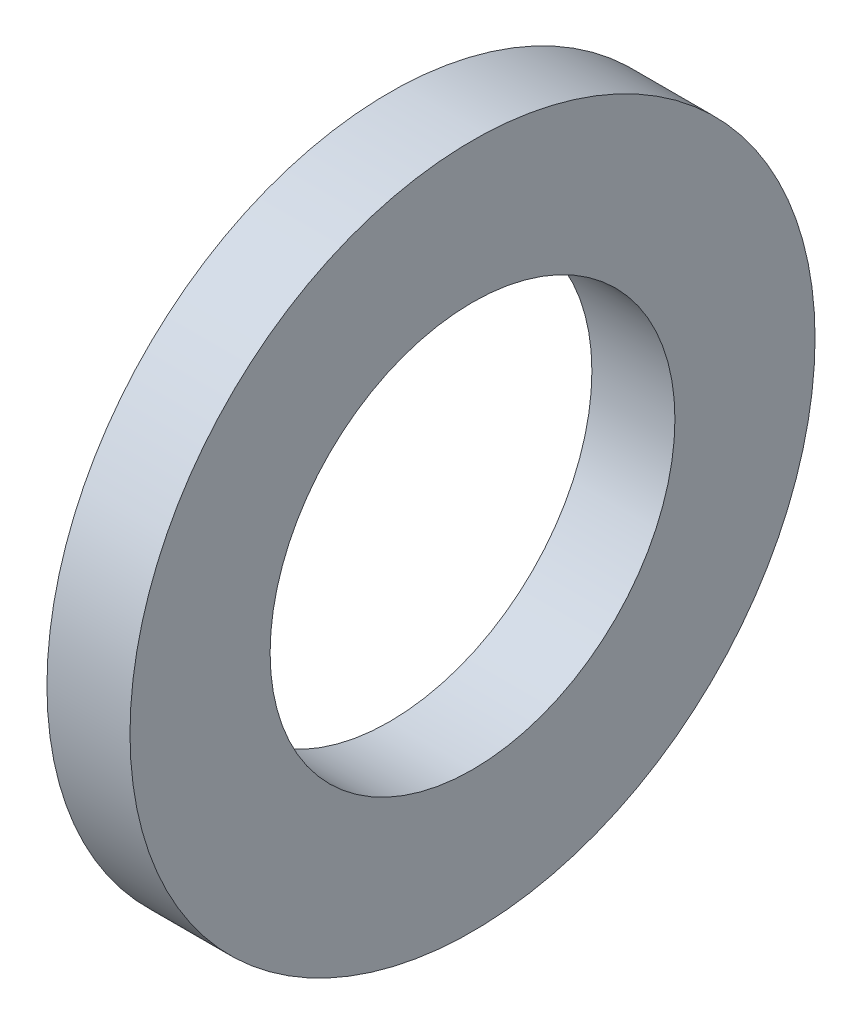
ISO-10303-21;
HEADER;
FILE_DESCRIPTION(('STEP AP214'),'2;1');
FILE_NAME('part.step','',(''),(''),'','','');
FILE_SCHEMA(('AUTOMOTIVE_DESIGN { 1 0 10303 214 1 1 1 1 }'));
ENDSEC;
DATA;
#1=APPLICATION_CONTEXT('core data for automotive mechanical design processes');
#2=APPLICATION_PROTOCOL_DEFINITION('international standard','automotive_design',2000,#1);
#3=PRODUCT_CONTEXT('',#1,'mechanical');
#4=PRODUCT('Part','Part','',(#3));
#5=PRODUCT_RELATED_PRODUCT_CATEGORY('part','',(#4));
#6=PRODUCT_DEFINITION_FORMATION('','',#4);
#7=PRODUCT_DEFINITION_CONTEXT('part definition',#1,'design');
#8=PRODUCT_DEFINITION('design','',#6,#7);
#9=PRODUCT_DEFINITION_SHAPE('','',#8);
#10=(LENGTH_UNIT() NAMED_UNIT(*) SI_UNIT(.MILLI.,.METRE.));
#11=(NAMED_UNIT(*) PLANE_ANGLE_UNIT() SI_UNIT($,.RADIAN.));
#12=(NAMED_UNIT(*) SI_UNIT($,.STERADIAN.) SOLID_ANGLE_UNIT());
#13=UNCERTAINTY_MEASURE_WITH_UNIT(LENGTH_MEASURE(1.E-05),#10,'distance_accuracy_value','');
#14=(GEOMETRIC_REPRESENTATION_CONTEXT(3) GLOBAL_UNCERTAINTY_ASSIGNED_CONTEXT((#13)) GLOBAL_UNIT_ASSIGNED_CONTEXT((#10,
#11,#12)) REPRESENTATION_CONTEXT('',''));
#15=CARTESIAN_POINT('',(0.,0.,0.));
#16=DIRECTION('',(0.,0.,1.));
#17=DIRECTION('',(1.,0.,0.));
#18=AXIS2_PLACEMENT_3D('',#15,#16,#17);
#19=CARTESIAN_POINT('',(8.,0.,0.));
#20=DIRECTION('',(1.,0.,0.));
#21=DIRECTION('',(0.,0.,-1.));
#22=AXIS2_PLACEMENT_3D('',#19,#20,#21);
#23=PLANE('',#22);
#24=CARTESIAN_POINT('',(8.,0.,0.));
#25=DIRECTION('',(1.,0.,0.));
#26=DIRECTION('',(0.,0.,-1.));
#27=AXIS2_PLACEMENT_3D('',#24,#25,#26);
#28=CIRCLE('',#27,33.);
#29=CARTESIAN_POINT('',(8.,0.,-33.));
#30=VERTEX_POINT('',#29);
#31=EDGE_CURVE('E10',#30,#30,#28,.T.);
#32=ORIENTED_EDGE('',*,*,#31,.T.);
#33=EDGE_LOOP('',(#32));
#34=FACE_BOUND('',#33,.T.);
#35=CARTESIAN_POINT('',(8.,0.,0.));
#36=DIRECTION('',(1.,0.,0.));
#37=DIRECTION('',(0.,0.,-1.));
#38=AXIS2_PLACEMENT_3D('',#35,#36,#37);
#39=CIRCLE('',#38,19.5);
#40=CARTESIAN_POINT('',(8.,0.,-19.5));
#41=VERTEX_POINT('',#40);
#42=EDGE_CURVE('E42',#41,#41,#39,.T.);
#43=ORIENTED_EDGE('',*,*,#42,.F.);
#44=EDGE_LOOP('',(#43));
#45=FACE_BOUND('',#44,.T.);
#46=ADVANCED_FACE('F31',(#34,#45),#23,.T.);
#47=CARTESIAN_POINT('',(0.,0.,0.));
#48=DIRECTION('',(1.,0.,0.));
#49=DIRECTION('',(0.,0.,-1.));
#50=AXIS2_PLACEMENT_3D('',#47,#48,#49);
#51=PLANE('',#50);
#52=CARTESIAN_POINT('',(0.,0.,0.));
#53=DIRECTION('',(1.,0.,0.));
#54=DIRECTION('',(0.,0.,-1.));
#55=AXIS2_PLACEMENT_3D('',#52,#53,#54);
#56=CIRCLE('',#55,33.);
#57=CARTESIAN_POINT('',(0.,0.,-33.));
#58=VERTEX_POINT('',#57);
#59=EDGE_CURVE('E35',#58,#58,#56,.T.);
#60=ORIENTED_EDGE('',*,*,#59,.F.);
#61=EDGE_LOOP('',(#60));
#62=FACE_BOUND('',#61,.T.);
#63=CARTESIAN_POINT('',(0.,0.,0.));
#64=DIRECTION('',(1.,0.,0.));
#65=DIRECTION('',(0.,0.,-1.));
#66=AXIS2_PLACEMENT_3D('',#63,#64,#65);
#67=CIRCLE('',#66,19.5);
#68=CARTESIAN_POINT('',(0.,0.,-19.5));
#69=VERTEX_POINT('',#68);
#70=EDGE_CURVE('E44',#69,#69,#67,.T.);
#71=ORIENTED_EDGE('',*,*,#70,.T.);
#72=EDGE_LOOP('',(#71));
#73=FACE_BOUND('',#72,.T.);
#74=ADVANCED_FACE('F54',(#62,#73),#51,.F.);
#75=CARTESIAN_POINT('',(8.,0.,0.));
#76=DIRECTION('',(-1.,0.,0.));
#77=DIRECTION('',(0.,0.,1.));
#78=AXIS2_PLACEMENT_3D('',#75,#76,#77);
#79=CYLINDRICAL_SURFACE('',#78,33.);
#80=ORIENTED_EDGE('',*,*,#31,.F.);
#81=EDGE_LOOP('',(#80));
#82=FACE_BOUND('',#81,.T.);
#83=ORIENTED_EDGE('',*,*,#59,.T.);
#84=EDGE_LOOP('',(#83));
#85=FACE_BOUND('',#84,.T.);
#86=ADVANCED_FACE('F33',(#82,#85),#79,.T.);
#87=CARTESIAN_POINT('',(8.,0.,0.));
#88=DIRECTION('',(-1.,0.,0.));
#89=DIRECTION('',(0.,0.,1.));
#90=AXIS2_PLACEMENT_3D('',#87,#88,#89);
#91=CYLINDRICAL_SURFACE('',#90,19.5);
#92=ORIENTED_EDGE('',*,*,#42,.T.);
#93=EDGE_LOOP('',(#92));
#94=FACE_BOUND('',#93,.T.);
#95=ORIENTED_EDGE('',*,*,#70,.F.);
#96=EDGE_LOOP('',(#95));
#97=FACE_BOUND('',#96,.T.);
#98=ADVANCED_FACE('F50',(#94,#97),#91,.F.);
#99=CLOSED_SHELL('',(#46,#74,#86,#98));
#100=MANIFOLD_SOLID_BREP('B2',#99);
#101=ADVANCED_BREP_SHAPE_REPRESENTATION('',(#18,#100),#14);
#102=SHAPE_DEFINITION_REPRESENTATION(#9,#101);
ENDSEC;
END-ISO-10303-21;
